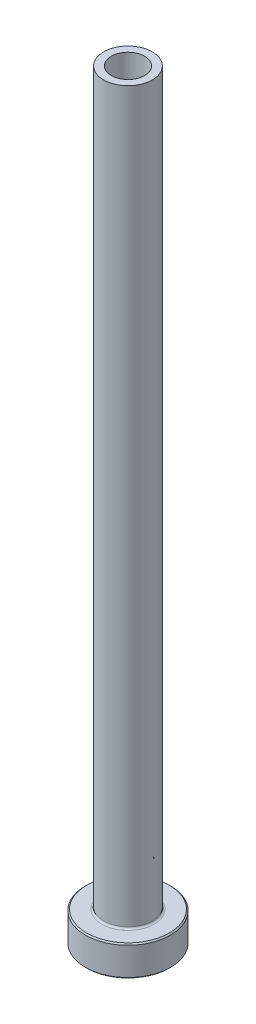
ISO-10303-21;
HEADER;
FILE_DESCRIPTION(('STEP AP214'),'2;1');
FILE_NAME('part.step','',(''),(''),'','','');
FILE_SCHEMA(('AUTOMOTIVE_DESIGN { 1 0 10303 214 1 1 1 1 }'));
ENDSEC;
DATA;
#1=APPLICATION_CONTEXT('core data for automotive mechanical design processes');
#2=APPLICATION_PROTOCOL_DEFINITION('international standard','automotive_design',2000,#1);
#3=PRODUCT_CONTEXT('',#1,'mechanical');
#4=PRODUCT('Part','Part','',(#3));
#5=PRODUCT_RELATED_PRODUCT_CATEGORY('part','',(#4));
#6=PRODUCT_DEFINITION_FORMATION('','',#4);
#7=PRODUCT_DEFINITION_CONTEXT('part definition',#1,'design');
#8=PRODUCT_DEFINITION('design','',#6,#7);
#9=PRODUCT_DEFINITION_SHAPE('','',#8);
#10=(LENGTH_UNIT() NAMED_UNIT(*) SI_UNIT(.MILLI.,.METRE.));
#11=(NAMED_UNIT(*) PLANE_ANGLE_UNIT() SI_UNIT($,.RADIAN.));
#12=(NAMED_UNIT(*) SI_UNIT($,.STERADIAN.) SOLID_ANGLE_UNIT());
#13=UNCERTAINTY_MEASURE_WITH_UNIT(LENGTH_MEASURE(1.E-05),#10,'distance_accuracy_value','');
#14=(GEOMETRIC_REPRESENTATION_CONTEXT(3) GLOBAL_UNCERTAINTY_ASSIGNED_CONTEXT((#13)) GLOBAL_UNIT_ASSIGNED_CONTEXT((#10,
#11,#12)) REPRESENTATION_CONTEXT('',''));
#15=CARTESIAN_POINT('',(0.,0.,0.));
#16=DIRECTION('',(0.,0.,1.));
#17=DIRECTION('',(1.,0.,0.));
#18=AXIS2_PLACEMENT_3D('',#15,#16,#17);
#19=CARTESIAN_POINT('',(0.,92.1876809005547,0.));
#20=DIRECTION('',(0.,1.,0.));
#21=DIRECTION('',(0.,0.,1.));
#22=AXIS2_PLACEMENT_3D('',#19,#20,#21);
#23=CYLINDRICAL_SURFACE('',#22,2.75);
#24=CARTESIAN_POINT('',(0.,125.,0.));
#25=DIRECTION('',(0.,1.,0.));
#26=DIRECTION('',(0.,0.,1.));
#27=AXIS2_PLACEMENT_3D('',#24,#25,#26);
#28=CIRCLE('',#27,2.75);
#29=CARTESIAN_POINT('',(0.,125.,2.75));
#30=VERTEX_POINT('',#29);
#31=EDGE_CURVE('E62',#30,#30,#28,.T.);
#32=ORIENTED_EDGE('',*,*,#31,.T.);
#33=EDGE_LOOP('',(#32));
#34=FACE_BOUND('',#33,.T.);
#35=CARTESIAN_POINT('',(0.,80.,0.));
#36=DIRECTION('',(0.,1.,0.));
#37=DIRECTION('',(0.,0.,1.));
#38=AXIS2_PLACEMENT_3D('',#35,#36,#37);
#39=CIRCLE('',#38,2.75);
#40=CARTESIAN_POINT('',(0.,80.,2.75));
#41=VERTEX_POINT('',#40);
#42=EDGE_CURVE('E71',#41,#41,#39,.T.);
#43=ORIENTED_EDGE('',*,*,#42,.F.);
#44=EDGE_LOOP('',(#43));
#45=FACE_BOUND('',#44,.T.);
#46=ADVANCED_FACE('F30',(#34,#45),#23,.F.);
#47=CARTESIAN_POINT('',(-2.75,125.,0.));
#48=DIRECTION('',(0.,1.,0.));
#49=DIRECTION('',(0.,0.,1.));
#50=AXIS2_PLACEMENT_3D('',#47,#48,#49);
#51=PLANE('',#50);
#52=CARTESIAN_POINT('',(0.,125.,0.));
#53=DIRECTION('',(0.,1.,0.));
#54=DIRECTION('',(0.,0.,1.));
#55=AXIS2_PLACEMENT_3D('',#52,#53,#54);
#56=CIRCLE('',#55,4.);
#57=CARTESIAN_POINT('',(0.,125.,4.));
#58=VERTEX_POINT('',#57);
#59=EDGE_CURVE('E65',#58,#58,#56,.T.);
#60=ORIENTED_EDGE('',*,*,#59,.T.);
#61=EDGE_LOOP('',(#60));
#62=FACE_BOUND('',#61,.T.);
#63=ORIENTED_EDGE('',*,*,#31,.F.);
#64=EDGE_LOOP('',(#63));
#65=FACE_BOUND('',#64,.T.);
#66=ADVANCED_FACE('F79',(#62,#65),#51,.T.);
#67=CARTESIAN_POINT('',(0.,92.1876809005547,0.));
#68=DIRECTION('',(0.,1.,0.));
#69=DIRECTION('',(0.,0.,1.));
#70=AXIS2_PLACEMENT_3D('',#67,#68,#69);
#71=CYLINDRICAL_SURFACE('',#70,4.);
#72=CARTESIAN_POINT('',(0.,5.3,0.));
#73=DIRECTION('',(0.,1.,0.));
#74=DIRECTION('',(0.,0.,1.));
#75=AXIS2_PLACEMENT_3D('',#72,#73,#74);
#76=CIRCLE('',#75,4.);
#77=CARTESIAN_POINT('',(0.,5.3,4.));
#78=VERTEX_POINT('',#77);
#79=EDGE_CURVE('E59',#78,#78,#76,.T.);
#80=ORIENTED_EDGE('',*,*,#79,.T.);
#81=EDGE_LOOP('',(#80));
#82=FACE_BOUND('',#81,.T.);
#83=ORIENTED_EDGE('',*,*,#59,.F.);
#84=EDGE_LOOP('',(#83));
#85=FACE_BOUND('',#84,.T.);
#86=ADVANCED_FACE('F85',(#82,#85),#71,.T.);
#87=CARTESIAN_POINT('',(-3.99999999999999,5.,0.));
#88=DIRECTION('',(0.,1.,0.));
#89=DIRECTION('',(0.,0.,1.));
#90=AXIS2_PLACEMENT_3D('',#87,#88,#89);
#91=PLANE('',#90);
#92=CARTESIAN_POINT('',(0.,5.,0.));
#93=DIRECTION('',(0.,1.,0.));
#94=DIRECTION('',(0.,0.,1.));
#95=AXIS2_PLACEMENT_3D('',#92,#93,#94);
#96=CIRCLE('',#95,6.79999999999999);
#97=CARTESIAN_POINT('',(0.,5.,6.79999999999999));
#98=VERTEX_POINT('',#97);
#99=EDGE_CURVE('E53',#98,#98,#96,.T.);
#100=ORIENTED_EDGE('',*,*,#99,.T.);
#101=EDGE_LOOP('',(#100));
#102=FACE_BOUND('',#101,.T.);
#103=CARTESIAN_POINT('',(0.,5.,0.));
#104=DIRECTION('',(0.,1.,0.));
#105=DIRECTION('',(0.,0.,1.));
#106=AXIS2_PLACEMENT_3D('',#103,#104,#105);
#107=CIRCLE('',#106,4.3);
#108=CARTESIAN_POINT('',(0.,5.,4.3));
#109=VERTEX_POINT('',#108);
#110=EDGE_CURVE('E56',#109,#109,#107,.F.);
#111=ORIENTED_EDGE('',*,*,#110,.T.);
#112=EDGE_LOOP('',(#111));
#113=FACE_BOUND('',#112,.T.);
#114=ADVANCED_FACE('F111',(#102,#113),#91,.T.);
#115=CARTESIAN_POINT('',(0.,92.1876809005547,0.));
#116=DIRECTION('',(0.,1.,0.));
#117=DIRECTION('',(0.,0.,1.));
#118=AXIS2_PLACEMENT_3D('',#115,#116,#117);
#119=CYLINDRICAL_SURFACE('',#118,6.99999999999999);
#120=CARTESIAN_POINT('',(0.,4.8,0.));
#121=DIRECTION('',(0.,1.,0.));
#122=DIRECTION('',(0.,0.,1.));
#123=AXIS2_PLACEMENT_3D('',#120,#121,#122);
#124=CIRCLE('',#123,6.99999999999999);
#125=CARTESIAN_POINT('',(0.,4.8,6.99999999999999));
#126=VERTEX_POINT('',#125);
#127=EDGE_CURVE('E45',#126,#126,#124,.F.);
#128=ORIENTED_EDGE('',*,*,#127,.T.);
#129=EDGE_LOOP('',(#128));
#130=FACE_BOUND('',#129,.T.);
#131=CARTESIAN_POINT('',(0.,0.200000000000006,0.));
#132=DIRECTION('',(0.,-1.,0.));
#133=DIRECTION('',(0.,0.,-1.));
#134=AXIS2_PLACEMENT_3D('',#131,#132,#133);
#135=CIRCLE('',#134,6.99999999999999);
#136=CARTESIAN_POINT('',(0.,0.200000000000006,-6.99999999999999));
#137=VERTEX_POINT('',#136);
#138=EDGE_CURVE('E50',#137,#137,#135,.F.);
#139=ORIENTED_EDGE('',*,*,#138,.T.);
#140=EDGE_LOOP('',(#139));
#141=FACE_BOUND('',#140,.T.);
#142=ADVANCED_FACE('F108',(#130,#141),#119,.T.);
#143=CARTESIAN_POINT('',(-6.99999999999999,0.,0.));
#144=DIRECTION('',(0.,-1.,0.));
#145=DIRECTION('',(0.,0.,-1.));
#146=AXIS2_PLACEMENT_3D('',#143,#144,#145);
#147=PLANE('',#146);
#148=CARTESIAN_POINT('',(0.,0.,0.));
#149=DIRECTION('',(0.,-1.,0.));
#150=DIRECTION('',(0.,0.,-1.));
#151=AXIS2_PLACEMENT_3D('',#148,#149,#150);
#152=CIRCLE('',#151,3.49999999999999);
#153=CARTESIAN_POINT('',(0.,0.,-3.49999999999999));
#154=VERTEX_POINT('',#153);
#155=EDGE_CURVE('E37',#154,#154,#152,.F.);
#156=ORIENTED_EDGE('',*,*,#155,.T.);
#157=EDGE_LOOP('',(#156));
#158=FACE_BOUND('',#157,.T.);
#159=CARTESIAN_POINT('',(0.,0.,0.));
#160=DIRECTION('',(0.,-1.,0.));
#161=DIRECTION('',(0.,0.,-1.));
#162=AXIS2_PLACEMENT_3D('',#159,#160,#161);
#163=CIRCLE('',#162,6.8);
#164=CARTESIAN_POINT('',(0.,0.,-6.8));
#165=VERTEX_POINT('',#164);
#166=EDGE_CURVE('E41',#165,#165,#163,.T.);
#167=ORIENTED_EDGE('',*,*,#166,.T.);
#168=EDGE_LOOP('',(#167));
#169=FACE_BOUND('',#168,.T.);
#170=ADVANCED_FACE('F110',(#158,#169),#147,.T.);
#171=CARTESIAN_POINT('',(0.,92.1876809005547,0.));
#172=DIRECTION('',(0.,1.,0.));
#173=DIRECTION('',(0.,0.,1.));
#174=AXIS2_PLACEMENT_3D('',#171,#172,#173);
#175=CYLINDRICAL_SURFACE('',#174,2.99999999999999);
#176=CARTESIAN_POINT('',(0.,0.5,0.));
#177=DIRECTION('',(0.,-1.,0.));
#178=DIRECTION('',(0.,0.,-1.));
#179=AXIS2_PLACEMENT_3D('',#176,#177,#178);
#180=CIRCLE('',#179,2.99999999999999);
#181=CARTESIAN_POINT('',(0.,0.5,-2.99999999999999));
#182=VERTEX_POINT('',#181);
#183=EDGE_CURVE('E10',#182,#182,#180,.T.);
#184=ORIENTED_EDGE('',*,*,#183,.T.);
#185=EDGE_LOOP('',(#184));
#186=FACE_BOUND('',#185,.T.);
#187=CARTESIAN_POINT('',(0.,68.,0.));
#188=DIRECTION('',(0.,1.,0.));
#189=DIRECTION('',(0.,0.,1.));
#190=AXIS2_PLACEMENT_3D('',#187,#188,#189);
#191=CIRCLE('',#190,3.);
#192=CARTESIAN_POINT('',(0.,68.,3.));
#193=VERTEX_POINT('',#192);
#194=EDGE_CURVE('E68',#193,#193,#191,.T.);
#195=ORIENTED_EDGE('',*,*,#194,.T.);
#196=EDGE_LOOP('',(#195));
#197=FACE_BOUND('',#196,.T.);
#198=ADVANCED_FACE('F118',(#186,#197),#175,.F.);
#199=CARTESIAN_POINT('',(0.,68.,0.));
#200=DIRECTION('',(0.,-1.,0.));
#201=DIRECTION('',(0.,0.,-1.));
#202=AXIS2_PLACEMENT_3D('',#199,#200,#201);
#203=CONICAL_SURFACE('',#202,3.,0.0208303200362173);
#204=ORIENTED_EDGE('',*,*,#42,.T.);
#205=EDGE_LOOP('',(#204));
#206=FACE_BOUND('',#205,.T.);
#207=ORIENTED_EDGE('',*,*,#194,.F.);
#208=EDGE_LOOP('',(#207));
#209=FACE_BOUND('',#208,.T.);
#210=ADVANCED_FACE('F75',(#206,#209),#203,.F.);
#211=CARTESIAN_POINT('',(0.,5.3,0.));
#212=DIRECTION('',(0.,1.,0.));
#213=DIRECTION('',(0.,0.,1.));
#214=AXIS2_PLACEMENT_3D('',#211,#212,#213);
#215=TOROIDAL_SURFACE('',#214,4.3,0.3);
#216=ORIENTED_EDGE('',*,*,#110,.F.);
#217=EDGE_LOOP('',(#216));
#218=FACE_BOUND('',#217,.T.);
#219=ORIENTED_EDGE('',*,*,#79,.F.);
#220=EDGE_LOOP('',(#219));
#221=FACE_BOUND('',#220,.T.);
#222=ADVANCED_FACE('F90',(#218,#221),#215,.F.);
#223=CARTESIAN_POINT('',(0.,5.,0.));
#224=DIRECTION('',(0.,-1.,0.));
#225=DIRECTION('',(0.,0.,-1.));
#226=AXIS2_PLACEMENT_3D('',#223,#224,#225);
#227=CONICAL_SURFACE('',#226,6.79999999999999,0.78539816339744);
#228=ORIENTED_EDGE('',*,*,#127,.F.);
#229=EDGE_LOOP('',(#228));
#230=FACE_BOUND('',#229,.T.);
#231=ORIENTED_EDGE('',*,*,#99,.F.);
#232=EDGE_LOOP('',(#231));
#233=FACE_BOUND('',#232,.T.);
#234=ADVANCED_FACE('F93',(#230,#233),#227,.T.);
#235=CARTESIAN_POINT('',(0.,0.200000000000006,0.));
#236=DIRECTION('',(0.,1.,0.));
#237=DIRECTION('',(0.,0.,1.));
#238=AXIS2_PLACEMENT_3D('',#235,#236,#237);
#239=CONICAL_SURFACE('',#238,6.99999999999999,0.785398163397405);
#240=ORIENTED_EDGE('',*,*,#166,.F.);
#241=EDGE_LOOP('',(#240));
#242=FACE_BOUND('',#241,.T.);
#243=ORIENTED_EDGE('',*,*,#138,.F.);
#244=EDGE_LOOP('',(#243));
#245=FACE_BOUND('',#244,.T.);
#246=ADVANCED_FACE('F96',(#242,#245),#239,.T.);
#247=CARTESIAN_POINT('',(0.,0.,0.));
#248=DIRECTION('',(0.,-1.,0.));
#249=DIRECTION('',(0.,0.,-1.));
#250=AXIS2_PLACEMENT_3D('',#247,#248,#249);
#251=CONICAL_SURFACE('',#250,3.49999999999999,0.785398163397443);
#252=ORIENTED_EDGE('',*,*,#183,.F.);
#253=EDGE_LOOP('',(#252));
#254=FACE_BOUND('',#253,.T.);
#255=ORIENTED_EDGE('',*,*,#155,.F.);
#256=EDGE_LOOP('',(#255));
#257=FACE_BOUND('',#256,.T.);
#258=ADVANCED_FACE('F32',(#254,#257),#251,.F.);
#259=CLOSED_SHELL('',(#46,#66,#86,#114,#142,#170,#198,#210,#222,#234,#246,#258));
#260=MANIFOLD_SOLID_BREP('B2',#259);
#261=ADVANCED_BREP_SHAPE_REPRESENTATION('',(#18,#260),#14);
#262=SHAPE_DEFINITION_REPRESENTATION(#9,#261);
ENDSEC;
END-ISO-10303-21;
